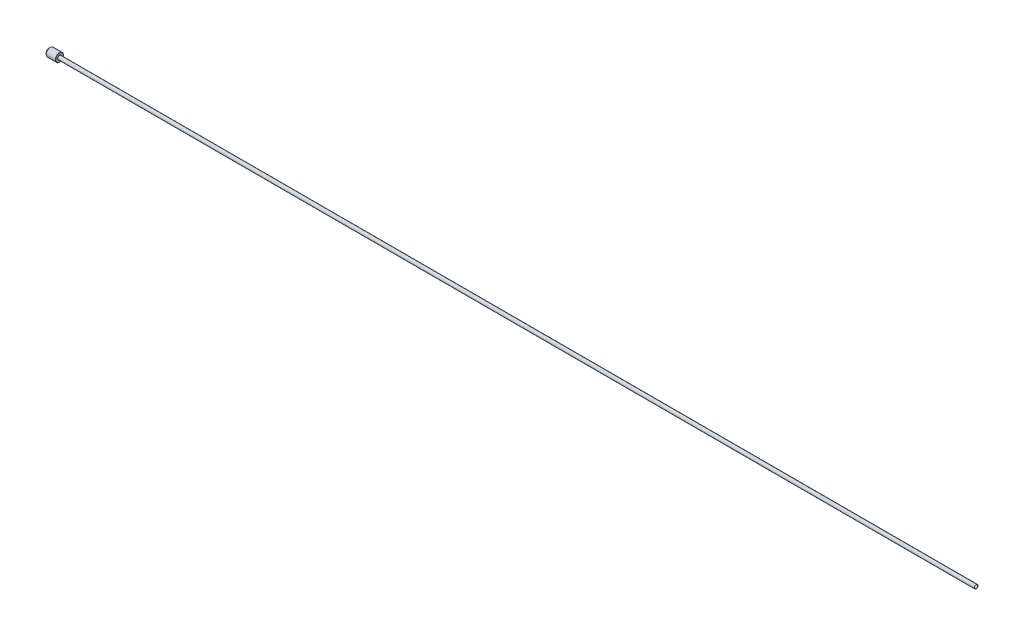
ISO-10303-21;
HEADER;
FILE_DESCRIPTION(('STEP AP214'),'2;1');
FILE_NAME('part.step','',(''),(''),'','','');
FILE_SCHEMA(('AUTOMOTIVE_DESIGN { 1 0 10303 214 1 1 1 1 }'));
ENDSEC;
DATA;
#1=APPLICATION_CONTEXT('core data for automotive mechanical design processes');
#2=APPLICATION_PROTOCOL_DEFINITION('international standard','automotive_design',2000,#1);
#3=PRODUCT_CONTEXT('',#1,'mechanical');
#4=PRODUCT('Part','Part','',(#3));
#5=PRODUCT_RELATED_PRODUCT_CATEGORY('part','',(#4));
#6=PRODUCT_DEFINITION_FORMATION('','',#4);
#7=PRODUCT_DEFINITION_CONTEXT('part definition',#1,'design');
#8=PRODUCT_DEFINITION('design','',#6,#7);
#9=PRODUCT_DEFINITION_SHAPE('','',#8);
#10=(LENGTH_UNIT() NAMED_UNIT(*) SI_UNIT(.MILLI.,.METRE.));
#11=(NAMED_UNIT(*) PLANE_ANGLE_UNIT() SI_UNIT($,.RADIAN.));
#12=(NAMED_UNIT(*) SI_UNIT($,.STERADIAN.) SOLID_ANGLE_UNIT());
#13=UNCERTAINTY_MEASURE_WITH_UNIT(LENGTH_MEASURE(1.E-05),#10,'distance_accuracy_value','');
#14=(GEOMETRIC_REPRESENTATION_CONTEXT(3) GLOBAL_UNCERTAINTY_ASSIGNED_CONTEXT((#13)) GLOBAL_UNIT_ASSIGNED_CONTEXT((#10,
#11,#12)) REPRESENTATION_CONTEXT('',''));
#15=CARTESIAN_POINT('',(0.,0.,0.));
#16=DIRECTION('',(0.,0.,1.));
#17=DIRECTION('',(1.,0.,0.));
#18=AXIS2_PLACEMENT_3D('',#15,#16,#17);
#19=CARTESIAN_POINT('',(5.,2.,0.));
#20=DIRECTION('',(-1.,0.,0.));
#21=DIRECTION('',(0.,0.,1.));
#22=AXIS2_PLACEMENT_3D('',#19,#20,#21);
#23=PLANE('',#22);
#24=CARTESIAN_POINT('',(5.,0.,0.));
#25=DIRECTION('',(-1.,0.,0.));
#26=DIRECTION('',(0.,0.,1.));
#27=AXIS2_PLACEMENT_3D('',#24,#25,#26);
#28=CIRCLE('',#27,1.9);
#29=CARTESIAN_POINT('',(5.,0.,1.9));
#30=VERTEX_POINT('',#29);
#31=EDGE_CURVE('E10',#30,#30,#28,.F.);
#32=ORIENTED_EDGE('',*,*,#31,.T.);
#33=EDGE_LOOP('',(#32));
#34=FACE_BOUND('',#33,.T.);
#35=CARTESIAN_POINT('',(5.,0.,0.));
#36=DIRECTION('',(-1.,0.,0.));
#37=DIRECTION('',(0.,0.,1.));
#38=AXIS2_PLACEMENT_3D('',#35,#36,#37);
#39=CIRCLE('',#38,0.9144);
#40=CARTESIAN_POINT('',(5.,0.,0.9144));
#41=VERTEX_POINT('',#40);
#42=EDGE_CURVE('E63',#41,#41,#39,.T.);
#43=ORIENTED_EDGE('',*,*,#42,.T.);
#44=EDGE_LOOP('',(#43));
#45=FACE_BOUND('',#44,.T.);
#46=ADVANCED_FACE('F31',(#34,#45),#23,.F.);
#47=CARTESIAN_POINT('',(-22.2121854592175,0.,0.));
#48=DIRECTION('',(-1.,0.,0.));
#49=DIRECTION('',(0.,0.,1.));
#50=AXIS2_PLACEMENT_3D('',#47,#48,#49);
#51=CYLINDRICAL_SURFACE('',#50,2.);
#52=CARTESIAN_POINT('',(4.9,0.,0.));
#53=DIRECTION('',(-1.,0.,0.));
#54=DIRECTION('',(0.,0.,1.));
#55=AXIS2_PLACEMENT_3D('',#52,#53,#54);
#56=CIRCLE('',#55,2.);
#57=CARTESIAN_POINT('',(4.9,0.,2.));
#58=VERTEX_POINT('',#57);
#59=EDGE_CURVE('E38',#58,#58,#56,.T.);
#60=ORIENTED_EDGE('',*,*,#59,.T.);
#61=EDGE_LOOP('',(#60));
#62=FACE_BOUND('',#61,.T.);
#63=CARTESIAN_POINT('',(0.494999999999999,0.,0.));
#64=DIRECTION('',(-1.,0.,0.));
#65=DIRECTION('',(0.,0.,1.));
#66=AXIS2_PLACEMENT_3D('',#63,#64,#65);
#67=CIRCLE('',#66,2.);
#68=CARTESIAN_POINT('',(0.494999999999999,0.,2.));
#69=VERTEX_POINT('',#68);
#70=EDGE_CURVE('E42',#69,#69,#67,.T.);
#71=ORIENTED_EDGE('',*,*,#70,.F.);
#72=EDGE_LOOP('',(#71));
#73=FACE_BOUND('',#72,.T.);
#74=ADVANCED_FACE('F101',(#62,#73),#51,.T.);
#75=CARTESIAN_POINT('',(0.494999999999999,0.,0.));
#76=DIRECTION('',(1.,0.,0.));
#77=DIRECTION('',(0.,0.,-1.));
#78=AXIS2_PLACEMENT_3D('',#75,#76,#77);
#79=CONICAL_SURFACE('',#78,2.,0.785398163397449);
#80=CARTESIAN_POINT('',(0.0999999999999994,0.,0.));
#81=DIRECTION('',(-1.,0.,0.));
#82=DIRECTION('',(0.,0.,1.));
#83=AXIS2_PLACEMENT_3D('',#80,#81,#82);
#84=CIRCLE('',#83,1.605);
#85=CARTESIAN_POINT('',(0.0999999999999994,0.,1.605));
#86=VERTEX_POINT('',#85);
#87=EDGE_CURVE('E46',#86,#86,#84,.T.);
#88=ORIENTED_EDGE('',*,*,#87,.F.);
#89=EDGE_LOOP('',(#88));
#90=FACE_BOUND('',#89,.T.);
#91=ORIENTED_EDGE('',*,*,#70,.T.);
#92=EDGE_LOOP('',(#91));
#93=FACE_BOUND('',#92,.T.);
#94=ADVANCED_FACE('F95',(#90,#93),#79,.T.);
#95=CARTESIAN_POINT('',(-22.2121854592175,0.,0.));
#96=DIRECTION('',(-1.,0.,0.));
#97=DIRECTION('',(0.,0.,1.));
#98=AXIS2_PLACEMENT_3D('',#95,#96,#97);
#99=CYLINDRICAL_SURFACE('',#98,1.605);
#100=CARTESIAN_POINT('',(0.,0.,0.));
#101=DIRECTION('',(-1.,0.,0.));
#102=DIRECTION('',(0.,0.,1.));
#103=AXIS2_PLACEMENT_3D('',#100,#101,#102);
#104=CIRCLE('',#103,1.605);
#105=CARTESIAN_POINT('',(0.,0.,1.605));
#106=VERTEX_POINT('',#105);
#107=EDGE_CURVE('E51',#106,#106,#104,.T.);
#108=ORIENTED_EDGE('',*,*,#107,.F.);
#109=EDGE_LOOP('',(#108));
#110=FACE_BOUND('',#109,.T.);
#111=ORIENTED_EDGE('',*,*,#87,.T.);
#112=EDGE_LOOP('',(#111));
#113=FACE_BOUND('',#112,.T.);
#114=ADVANCED_FACE('F89',(#110,#113),#99,.T.);
#115=CARTESIAN_POINT('',(0.,0.761999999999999,0.));
#116=DIRECTION('',(1.,0.,0.));
#117=DIRECTION('',(0.,0.,-1.));
#118=AXIS2_PLACEMENT_3D('',#115,#116,#117);
#119=PLANE('',#118);
#120=CARTESIAN_POINT('',(0.,0.,0.));
#121=DIRECTION('',(-1.,0.,0.));
#122=DIRECTION('',(0.,0.,1.));
#123=AXIS2_PLACEMENT_3D('',#120,#121,#122);
#124=CIRCLE('',#123,0.761999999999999);
#125=CARTESIAN_POINT('',(0.,0.,0.761999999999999));
#126=VERTEX_POINT('',#125);
#127=EDGE_CURVE('E54',#126,#126,#124,.T.);
#128=ORIENTED_EDGE('',*,*,#127,.F.);
#129=EDGE_LOOP('',(#128));
#130=FACE_BOUND('',#129,.T.);
#131=ORIENTED_EDGE('',*,*,#107,.T.);
#132=EDGE_LOOP('',(#131));
#133=FACE_BOUND('',#132,.T.);
#134=ADVANCED_FACE('F83',(#130,#133),#119,.F.);
#135=CARTESIAN_POINT('',(-22.2121854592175,0.,0.));
#136=DIRECTION('',(-1.,0.,0.));
#137=DIRECTION('',(0.,0.,1.));
#138=AXIS2_PLACEMENT_3D('',#135,#136,#137);
#139=CYLINDRICAL_SURFACE('',#138,0.762000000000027);
#140=CARTESIAN_POINT('',(450.,0.,0.));
#141=DIRECTION('',(-1.,0.,0.));
#142=DIRECTION('',(0.,0.,1.));
#143=AXIS2_PLACEMENT_3D('',#140,#141,#142);
#144=CIRCLE('',#143,0.762000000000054);
#145=CARTESIAN_POINT('',(450.,0.,0.762000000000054));
#146=VERTEX_POINT('',#145);
#147=EDGE_CURVE('E57',#146,#146,#144,.T.);
#148=ORIENTED_EDGE('',*,*,#147,.F.);
#149=EDGE_LOOP('',(#148));
#150=FACE_BOUND('',#149,.T.);
#151=ORIENTED_EDGE('',*,*,#127,.T.);
#152=EDGE_LOOP('',(#151));
#153=FACE_BOUND('',#152,.T.);
#154=ADVANCED_FACE('F77',(#150,#153),#139,.F.);
#155=CARTESIAN_POINT('',(450.,0.9144,0.));
#156=DIRECTION('',(-1.,0.,0.));
#157=DIRECTION('',(0.,0.,1.));
#158=AXIS2_PLACEMENT_3D('',#155,#156,#157);
#159=PLANE('',#158);
#160=CARTESIAN_POINT('',(450.,0.,0.));
#161=DIRECTION('',(-1.,0.,0.));
#162=DIRECTION('',(0.,0.,1.));
#163=AXIS2_PLACEMENT_3D('',#160,#161,#162);
#164=CIRCLE('',#163,0.9144);
#165=CARTESIAN_POINT('',(450.,0.,0.9144));
#166=VERTEX_POINT('',#165);
#167=EDGE_CURVE('E60',#166,#166,#164,.T.);
#168=ORIENTED_EDGE('',*,*,#167,.F.);
#169=EDGE_LOOP('',(#168));
#170=FACE_BOUND('',#169,.T.);
#171=ORIENTED_EDGE('',*,*,#147,.T.);
#172=EDGE_LOOP('',(#171));
#173=FACE_BOUND('',#172,.T.);
#174=ADVANCED_FACE('F71',(#170,#173),#159,.F.);
#175=CARTESIAN_POINT('',(-22.2121854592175,0.,0.));
#176=DIRECTION('',(-1.,0.,0.));
#177=DIRECTION('',(0.,0.,1.));
#178=AXIS2_PLACEMENT_3D('',#175,#176,#177);
#179=CYLINDRICAL_SURFACE('',#178,0.9144);
#180=ORIENTED_EDGE('',*,*,#42,.F.);
#181=EDGE_LOOP('',(#180));
#182=FACE_BOUND('',#181,.T.);
#183=ORIENTED_EDGE('',*,*,#167,.T.);
#184=EDGE_LOOP('',(#183));
#185=FACE_BOUND('',#184,.T.);
#186=ADVANCED_FACE('F68',(#182,#185),#179,.T.);
#187=CARTESIAN_POINT('',(4.9,0.,0.));
#188=DIRECTION('',(-1.,0.,0.));
#189=DIRECTION('',(0.,0.,1.));
#190=AXIS2_PLACEMENT_3D('',#187,#188,#189);
#191=TOROIDAL_SURFACE('',#190,1.9,0.1);
#192=ORIENTED_EDGE('',*,*,#31,.F.);
#193=EDGE_LOOP('',(#192));
#194=FACE_BOUND('',#193,.T.);
#195=ORIENTED_EDGE('',*,*,#59,.F.);
#196=EDGE_LOOP('',(#195));
#197=FACE_BOUND('',#196,.T.);
#198=ADVANCED_FACE('F33',(#194,#197),#191,.T.);
#199=CLOSED_SHELL('',(#46,#74,#94,#114,#134,#154,#174,#186,#198));
#200=MANIFOLD_SOLID_BREP('B2',#199);
#201=ADVANCED_BREP_SHAPE_REPRESENTATION('',(#18,#200),#14);
#202=SHAPE_DEFINITION_REPRESENTATION(#9,#201);
ENDSEC;
END-ISO-10303-21;
